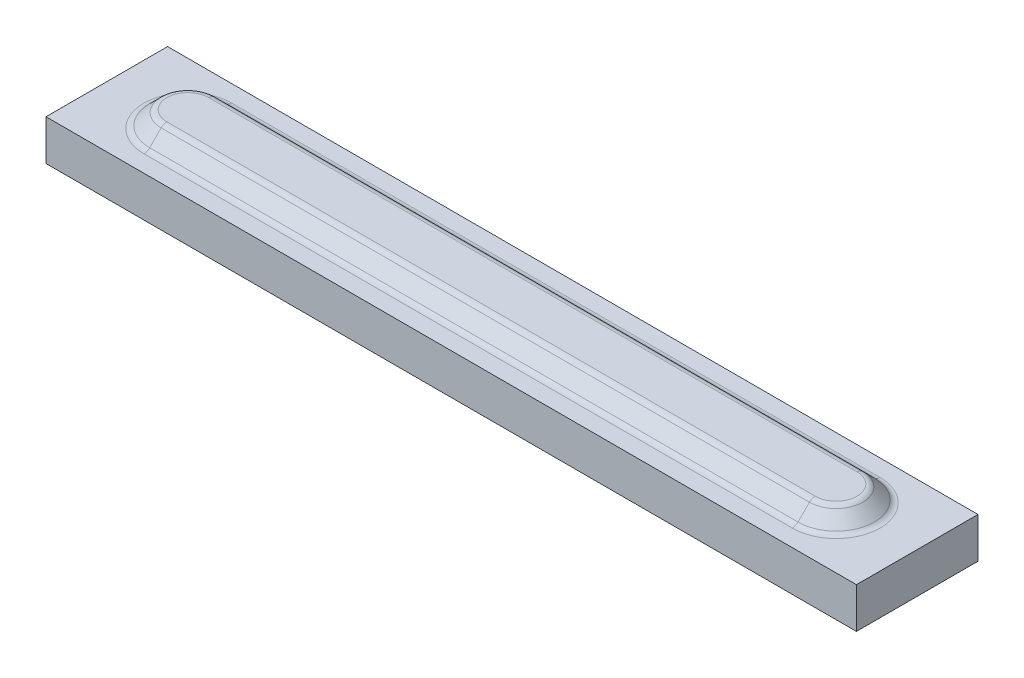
from build123d import *

# Parameters (mm, degrees)
BOSS_EXTRUDE1_DEPTH = 4
BOSS_EXTRUDE1_TAPER = 45
SKETCH1_3_W         = 200
SKETCH1_3_H         = 30
BOSS_EXTRUDE2_DEPTH = 10
FILLET2_R           = 2


with BuildPart() as part:
    # Sketch1 → Boss-Extrude1 (new body)
    with BuildSketch(Plane(origin=(0, 0, 0), x_dir=(1, 0, 0), z_dir=(0, 1, 0))):
        with BuildLine():
            Line((-80, -10), (80, -10))
            ThreePointArc((80, -10), (90, 0), (80, 10))
            Line((80, 10), (-80, 10))
            ThreePointArc((-80, 10), (-90, 0), (-80, -10))
        make_face()
    extrude(amount=BOSS_EXTRUDE1_DEPTH, taper=BOSS_EXTRUDE1_TAPER)

    # Sketch1_3 → Boss-Extrude2 (add)
    # profile 1 of 2: a face of its own
    with BuildSketch(Plane(origin=(0, 0, 0), x_dir=(1, 0, 0), z_dir=(0, 1, 0))):
        Rectangle(SKETCH1_3_W, SKETCH1_3_H)
        with BuildLine():
            ThreePointArc((80, -10), (90, 0), (80, 10))
            Line((80, 10), (-80, 10))
            ThreePointArc((-80, 10), (-90, 0), (-80, -10))
            Line((-80, -10), (80, -10))
        make_face(mode=Mode.SUBTRACT)
    # profile 2 of 2: a face of its own
    with BuildSketch(Plane(origin=(0, 0, 0), x_dir=(1, 0, 0), z_dir=(0, 1, 0))):
        with BuildLine():
            Line((-80, -10), (80, -10))
            ThreePointArc((80, -10), (90, 0), (80, 10))
            Line((80, 10), (-80, 10))
            ThreePointArc((-80, 10), (-90, 0), (-80, -10))
        make_face()
    extrude(amount=-BOSS_EXTRUDE2_DEPTH)

    # Fillet2
    fillet2_edges = [part.edges().sort_by_distance(p)[0] for p in [
        (0, 4, -6),
        (-86, 4, 0),
        (0, 4, 6),
        (-90, 0, 0),
        (0, 0, -10),
        (90, 0, 0),
        (0, 0, 10),
        (86, 4, 0),
    ]]
    fillet(fillet2_edges, radius=FILLET2_R)


solid = part.part
